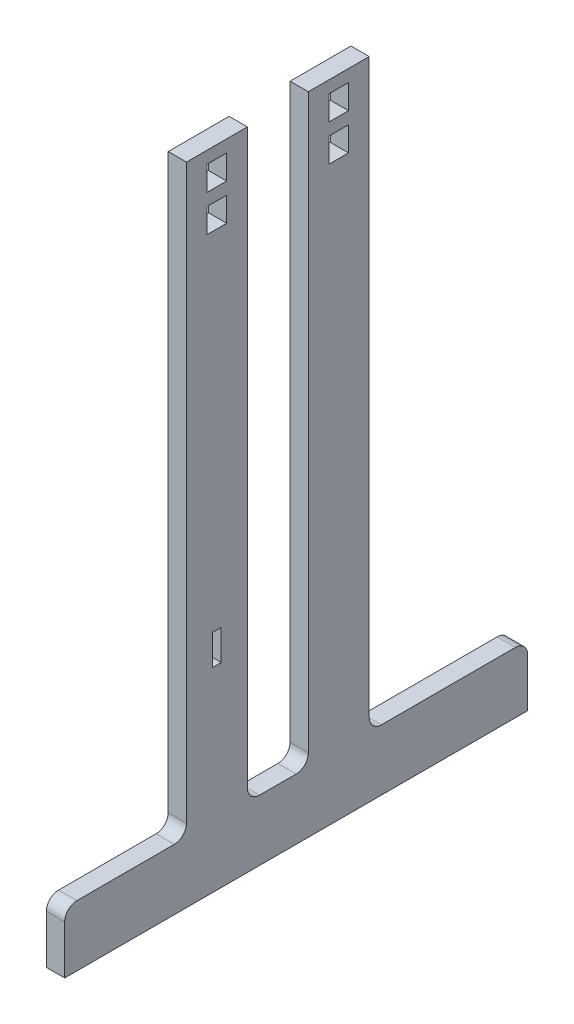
ISO-10303-21;
HEADER;
FILE_DESCRIPTION(('STEP AP214'),'2;1');
FILE_NAME('part.step','',(''),(''),'','','');
FILE_SCHEMA(('AUTOMOTIVE_DESIGN { 1 0 10303 214 1 1 1 1 }'));
ENDSEC;
DATA;
#1=APPLICATION_CONTEXT('core data for automotive mechanical design processes');
#2=APPLICATION_PROTOCOL_DEFINITION('international standard','automotive_design',2000,#1);
#3=PRODUCT_CONTEXT('',#1,'mechanical');
#4=PRODUCT('Part','Part','',(#3));
#5=PRODUCT_RELATED_PRODUCT_CATEGORY('part','',(#4));
#6=PRODUCT_DEFINITION_FORMATION('','',#4);
#7=PRODUCT_DEFINITION_CONTEXT('part definition',#1,'design');
#8=PRODUCT_DEFINITION('design','',#6,#7);
#9=PRODUCT_DEFINITION_SHAPE('','',#8);
#10=(LENGTH_UNIT() NAMED_UNIT(*) SI_UNIT(.MILLI.,.METRE.));
#11=(NAMED_UNIT(*) PLANE_ANGLE_UNIT() SI_UNIT($,.RADIAN.));
#12=(NAMED_UNIT(*) SI_UNIT($,.STERADIAN.) SOLID_ANGLE_UNIT());
#13=UNCERTAINTY_MEASURE_WITH_UNIT(LENGTH_MEASURE(1.E-05),#10,'distance_accuracy_value','');
#14=(GEOMETRIC_REPRESENTATION_CONTEXT(3) GLOBAL_UNCERTAINTY_ASSIGNED_CONTEXT((#13)) GLOBAL_UNIT_ASSIGNED_CONTEXT((#10,
#11,#12)) REPRESENTATION_CONTEXT('',''));
#15=CARTESIAN_POINT('',(0.,0.,0.));
#16=DIRECTION('',(0.,0.,1.));
#17=DIRECTION('',(1.,0.,0.));
#18=AXIS2_PLACEMENT_3D('',#15,#16,#17);
#19=CARTESIAN_POINT('',(15.,0.,0.));
#20=DIRECTION('',(1.,0.,0.));
#21=DIRECTION('',(0.,0.,-1.));
#22=AXIS2_PLACEMENT_3D('',#19,#20,#21);
#23=PLANE('',#22);
#24=DIRECTION('',(0.,1.,0.));
#25=VECTOR('',#24,1.);
#26=CARTESIAN_POINT('',(15.,0.,-380.));
#27=LINE('',#26,#25);
#28=CARTESIAN_POINT('',(15.,0.,-380.));
#29=VERTEX_POINT('',#28);
#30=CARTESIAN_POINT('',(15.,40.,-380.));
#31=VERTEX_POINT('',#30);
#32=EDGE_CURVE('E459',#29,#31,#27,.T.);
#33=ORIENTED_EDGE('',*,*,#32,.T.);
#34=CARTESIAN_POINT('',(15.,40.,-370.));
#35=DIRECTION('',(1.,0.,0.));
#36=DIRECTION('',(0.,0.,-1.));
#37=AXIS2_PLACEMENT_3D('',#34,#35,#36);
#38=CIRCLE('',#37,10.);
#39=CARTESIAN_POINT('',(15.,50.,-370.));
#40=VERTEX_POINT('',#39);
#41=EDGE_CURVE('E11',#31,#40,#38,.T.);
#42=ORIENTED_EDGE('',*,*,#41,.T.);
#43=DIRECTION('',(0.,0.,1.));
#44=VECTOR('',#43,1.);
#45=CARTESIAN_POINT('',(15.,50.,-380.));
#46=LINE('',#45,#44);
#47=CARTESIAN_POINT('',(15.,50.,-260.));
#48=VERTEX_POINT('',#47);
#49=EDGE_CURVE('E462',#40,#48,#46,.T.);
#50=ORIENTED_EDGE('',*,*,#49,.T.);
#51=CARTESIAN_POINT('',(15.,60.,-260.));
#52=DIRECTION('',(1.,0.,0.));
#53=DIRECTION('',(0.,0.,-1.));
#54=AXIS2_PLACEMENT_3D('',#51,#52,#53);
#55=CIRCLE('',#54,10.);
#56=CARTESIAN_POINT('',(15.,60.,-250.));
#57=VERTEX_POINT('',#56);
#58=EDGE_CURVE('E550',#48,#57,#55,.F.);
#59=ORIENTED_EDGE('',*,*,#58,.T.);
#60=DIRECTION('',(0.,1.,0.));
#61=VECTOR('',#60,1.);
#62=CARTESIAN_POINT('',(15.,50.,-250.));
#63=LINE('',#62,#61);
#64=CARTESIAN_POINT('',(15.,530.,-250.));
#65=VERTEX_POINT('',#64);
#66=EDGE_CURVE('E464',#57,#65,#63,.T.);
#67=ORIENTED_EDGE('',*,*,#66,.T.);
#68=DIRECTION('',(0.,0.,1.));
#69=VECTOR('',#68,1.);
#70=CARTESIAN_POINT('',(15.,530.,-250.));
#71=LINE('',#70,#69);
#72=CARTESIAN_POINT('',(15.,530.,-200.));
#73=VERTEX_POINT('',#72);
#74=EDGE_CURVE('E466',#65,#73,#71,.T.);
#75=ORIENTED_EDGE('',*,*,#74,.T.);
#76=DIRECTION('',(0.,-1.,0.));
#77=VECTOR('',#76,1.);
#78=CARTESIAN_POINT('',(15.,530.,-200.));
#79=LINE('',#78,#77);
#80=CARTESIAN_POINT('',(15.,60.0000000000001,-200.));
#81=VERTEX_POINT('',#80);
#82=EDGE_CURVE('E468',#73,#81,#79,.T.);
#83=ORIENTED_EDGE('',*,*,#82,.T.);
#84=CARTESIAN_POINT('',(15.,60.,-190.));
#85=DIRECTION('',(1.,0.,0.));
#86=DIRECTION('',(0.,0.,-1.));
#87=AXIS2_PLACEMENT_3D('',#84,#85,#86);
#88=CIRCLE('',#87,10.);
#89=CARTESIAN_POINT('',(15.,50.,-190.));
#90=VERTEX_POINT('',#89);
#91=EDGE_CURVE('E554',#81,#90,#88,.F.);
#92=ORIENTED_EDGE('',*,*,#91,.T.);
#93=DIRECTION('',(0.,0.,1.));
#94=VECTOR('',#93,1.);
#95=CARTESIAN_POINT('',(15.,50.,-200.));
#96=LINE('',#95,#94);
#97=CARTESIAN_POINT('',(15.,50.,-160.));
#98=VERTEX_POINT('',#97);
#99=EDGE_CURVE('E471',#90,#98,#96,.T.);
#100=ORIENTED_EDGE('',*,*,#99,.T.);
#101=CARTESIAN_POINT('',(15.,60.,-160.));
#102=DIRECTION('',(1.,0.,0.));
#103=DIRECTION('',(0.,0.,-1.));
#104=AXIS2_PLACEMENT_3D('',#101,#102,#103);
#105=CIRCLE('',#104,10.);
#106=CARTESIAN_POINT('',(15.,60.,-150.));
#107=VERTEX_POINT('',#106);
#108=EDGE_CURVE('E558',#98,#107,#105,.F.);
#109=ORIENTED_EDGE('',*,*,#108,.T.);
#110=DIRECTION('',(0.,1.,0.));
#111=VECTOR('',#110,1.);
#112=CARTESIAN_POINT('',(15.,50.,-150.));
#113=LINE('',#112,#111);
#114=CARTESIAN_POINT('',(15.,530.,-150.));
#115=VERTEX_POINT('',#114);
#116=EDGE_CURVE('E474',#107,#115,#113,.T.);
#117=ORIENTED_EDGE('',*,*,#116,.T.);
#118=DIRECTION('',(0.,0.,1.));
#119=VECTOR('',#118,1.);
#120=CARTESIAN_POINT('',(15.,530.,-150.));
#121=LINE('',#120,#119);
#122=CARTESIAN_POINT('',(15.,530.,-99.9999999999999));
#123=VERTEX_POINT('',#122);
#124=EDGE_CURVE('E476',#115,#123,#121,.T.);
#125=ORIENTED_EDGE('',*,*,#124,.T.);
#126=DIRECTION('',(0.,-1.,0.));
#127=VECTOR('',#126,1.);
#128=CARTESIAN_POINT('',(15.,530.,-99.9999999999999));
#129=LINE('',#128,#127);
#130=CARTESIAN_POINT('',(15.,60.,-100.));
#131=VERTEX_POINT('',#130);
#132=EDGE_CURVE('E478',#123,#131,#129,.T.);
#133=ORIENTED_EDGE('',*,*,#132,.T.);
#134=CARTESIAN_POINT('',(15.,60.,-90.));
#135=DIRECTION('',(1.,0.,0.));
#136=DIRECTION('',(0.,0.,-1.));
#137=AXIS2_PLACEMENT_3D('',#134,#135,#136);
#138=CIRCLE('',#137,10.);
#139=CARTESIAN_POINT('',(15.,50.,-90.));
#140=VERTEX_POINT('',#139);
#141=EDGE_CURVE('E562',#131,#140,#138,.F.);
#142=ORIENTED_EDGE('',*,*,#141,.T.);
#143=DIRECTION('',(0.,0.,1.));
#144=VECTOR('',#143,1.);
#145=CARTESIAN_POINT('',(15.,50.,-100.));
#146=LINE('',#145,#144);
#147=CARTESIAN_POINT('',(15.,50.,-9.99999999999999));
#148=VERTEX_POINT('',#147);
#149=EDGE_CURVE('E451',#140,#148,#146,.T.);
#150=ORIENTED_EDGE('',*,*,#149,.T.);
#151=CARTESIAN_POINT('',(15.,40.,-9.99999999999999));
#152=DIRECTION('',(1.,0.,0.));
#153=DIRECTION('',(0.,0.,-1.));
#154=AXIS2_PLACEMENT_3D('',#151,#152,#153);
#155=CIRCLE('',#154,10.);
#156=CARTESIAN_POINT('',(15.,40.,0.));
#157=VERTEX_POINT('',#156);
#158=EDGE_CURVE('E572',#148,#157,#155,.T.);
#159=ORIENTED_EDGE('',*,*,#158,.T.);
#160=DIRECTION('',(0.,-1.,0.));
#161=VECTOR('',#160,1.);
#162=CARTESIAN_POINT('',(15.,50.,0.));
#163=LINE('',#162,#161);
#164=CARTESIAN_POINT('',(15.,0.,0.));
#165=VERTEX_POINT('',#164);
#166=EDGE_CURVE('E454',#157,#165,#163,.T.);
#167=ORIENTED_EDGE('',*,*,#166,.T.);
#168=DIRECTION('',(0.,0.,-1.));
#169=VECTOR('',#168,1.);
#170=CARTESIAN_POINT('',(15.,0.,0.));
#171=LINE('',#170,#169);
#172=EDGE_CURVE('E457',#165,#29,#171,.T.);
#173=ORIENTED_EDGE('',*,*,#172,.T.);
#174=EDGE_LOOP('',(#33,#42,#50,#59,#67,#75,#83,#92,#100,#109,#117,#125,#133,#142,#150,#159,#167,#173));
#175=FACE_BOUND('',#174,.T.);
#176=DIRECTION('',(0.,0.,1.));
#177=VECTOR('',#176,1.);
#178=CARTESIAN_POINT('',(15.,520.,-117.));
#179=LINE('',#178,#177);
#180=CARTESIAN_POINT('',(15.,520.,-133.));
#181=VERTEX_POINT('',#180);
#182=CARTESIAN_POINT('',(15.,520.,-117.));
#183=VERTEX_POINT('',#182);
#184=EDGE_CURVE('E422',#181,#183,#179,.T.);
#185=ORIENTED_EDGE('',*,*,#184,.F.);
#186=DIRECTION('',(0.,1.,0.));
#187=VECTOR('',#186,1.);
#188=CARTESIAN_POINT('',(15.,520.,-133.));
#189=LINE('',#188,#187);
#190=CARTESIAN_POINT('',(15.,500.,-133.));
#191=VERTEX_POINT('',#190);
#192=EDGE_CURVE('E420',#191,#181,#189,.T.);
#193=ORIENTED_EDGE('',*,*,#192,.F.);
#194=DIRECTION('',(0.,0.,-1.));
#195=VECTOR('',#194,1.);
#196=CARTESIAN_POINT('',(15.,500.,-117.));
#197=LINE('',#196,#195);
#198=CARTESIAN_POINT('',(15.,500.,-117.));
#199=VERTEX_POINT('',#198);
#200=EDGE_CURVE('E428',#199,#191,#197,.T.);
#201=ORIENTED_EDGE('',*,*,#200,.F.);
#202=DIRECTION('',(0.,-1.,0.));
#203=VECTOR('',#202,1.);
#204=CARTESIAN_POINT('',(15.,520.,-117.));
#205=LINE('',#204,#203);
#206=EDGE_CURVE('E425',#183,#199,#205,.T.);
#207=ORIENTED_EDGE('',*,*,#206,.F.);
#208=EDGE_LOOP('',(#185,#193,#201,#207));
#209=FACE_BOUND('',#208,.T.);
#210=DIRECTION('',(0.,0.,1.));
#211=VECTOR('',#210,1.);
#212=CARTESIAN_POINT('',(15.,490.,-217.));
#213=LINE('',#212,#211);
#214=CARTESIAN_POINT('',(15.,490.,-233.));
#215=VERTEX_POINT('',#214);
#216=CARTESIAN_POINT('',(15.,490.,-217.));
#217=VERTEX_POINT('',#216);
#218=EDGE_CURVE('E355',#215,#217,#213,.T.);
#219=ORIENTED_EDGE('',*,*,#218,.F.);
#220=DIRECTION('',(0.,1.,0.));
#221=VECTOR('',#220,1.);
#222=CARTESIAN_POINT('',(15.,490.,-233.));
#223=LINE('',#222,#221);
#224=CARTESIAN_POINT('',(15.,470.,-233.));
#225=VERTEX_POINT('',#224);
#226=EDGE_CURVE('E341',#225,#215,#223,.T.);
#227=ORIENTED_EDGE('',*,*,#226,.F.);
#228=DIRECTION('',(0.,0.,-1.));
#229=VECTOR('',#228,1.);
#230=CARTESIAN_POINT('',(15.,470.,-217.));
#231=LINE('',#230,#229);
#232=CARTESIAN_POINT('',(15.,470.,-217.));
#233=VERTEX_POINT('',#232);
#234=EDGE_CURVE('E336',#233,#225,#231,.T.);
#235=ORIENTED_EDGE('',*,*,#234,.F.);
#236=DIRECTION('',(0.,-1.,0.));
#237=VECTOR('',#236,1.);
#238=CARTESIAN_POINT('',(15.,490.,-217.));
#239=LINE('',#238,#237);
#240=EDGE_CURVE('E352',#217,#233,#239,.T.);
#241=ORIENTED_EDGE('',*,*,#240,.F.);
#242=EDGE_LOOP('',(#219,#227,#235,#241));
#243=FACE_BOUND('',#242,.T.);
#244=DIRECTION('',(0.,0.,1.));
#245=VECTOR('',#244,1.);
#246=CARTESIAN_POINT('',(15.,490.,-117.));
#247=LINE('',#246,#245);
#248=CARTESIAN_POINT('',(15.,490.,-133.));
#249=VERTEX_POINT('',#248);
#250=CARTESIAN_POINT('',(15.,490.,-117.));
#251=VERTEX_POINT('',#250);
#252=EDGE_CURVE('E417',#249,#251,#247,.T.);
#253=ORIENTED_EDGE('',*,*,#252,.F.);
#254=DIRECTION('',(0.,1.,0.));
#255=VECTOR('',#254,1.);
#256=CARTESIAN_POINT('',(15.,490.,-133.));
#257=LINE('',#256,#255);
#258=CARTESIAN_POINT('',(15.,470.,-133.));
#259=VERTEX_POINT('',#258);
#260=EDGE_CURVE('E405',#259,#249,#257,.T.);
#261=ORIENTED_EDGE('',*,*,#260,.F.);
#262=DIRECTION('',(0.,0.,-1.));
#263=VECTOR('',#262,1.);
#264=CARTESIAN_POINT('',(15.,470.,-117.));
#265=LINE('',#264,#263);
#266=CARTESIAN_POINT('',(15.,470.,-117.));
#267=VERTEX_POINT('',#266);
#268=EDGE_CURVE('E400',#267,#259,#265,.T.);
#269=ORIENTED_EDGE('',*,*,#268,.F.);
#270=DIRECTION('',(0.,-1.,0.));
#271=VECTOR('',#270,1.);
#272=CARTESIAN_POINT('',(15.,490.,-117.));
#273=LINE('',#272,#271);
#274=EDGE_CURVE('E414',#251,#267,#273,.T.);
#275=ORIENTED_EDGE('',*,*,#274,.F.);
#276=EDGE_LOOP('',(#253,#261,#269,#275));
#277=FACE_BOUND('',#276,.T.);
#278=DIRECTION('',(0.,0.,1.));
#279=VECTOR('',#278,1.);
#280=CARTESIAN_POINT('',(15.,520.,-217.));
#281=LINE('',#280,#279);
#282=CARTESIAN_POINT('',(15.,520.,-233.));
#283=VERTEX_POINT('',#282);
#284=CARTESIAN_POINT('',(15.,520.,-217.));
#285=VERTEX_POINT('',#284);
#286=EDGE_CURVE('E388',#283,#285,#281,.T.);
#287=ORIENTED_EDGE('',*,*,#286,.F.);
#288=DIRECTION('',(0.,1.,0.));
#289=VECTOR('',#288,1.);
#290=CARTESIAN_POINT('',(15.,520.,-233.));
#291=LINE('',#290,#289);
#292=CARTESIAN_POINT('',(15.,500.,-233.));
#293=VERTEX_POINT('',#292);
#294=EDGE_CURVE('E374',#293,#283,#291,.T.);
#295=ORIENTED_EDGE('',*,*,#294,.F.);
#296=DIRECTION('',(0.,0.,-1.));
#297=VECTOR('',#296,1.);
#298=CARTESIAN_POINT('',(15.,500.,-217.));
#299=LINE('',#298,#297);
#300=CARTESIAN_POINT('',(15.,500.,-217.));
#301=VERTEX_POINT('',#300);
#302=EDGE_CURVE('E369',#301,#293,#299,.T.);
#303=ORIENTED_EDGE('',*,*,#302,.F.);
#304=DIRECTION('',(0.,-1.,0.));
#305=VECTOR('',#304,1.);
#306=CARTESIAN_POINT('',(15.,520.,-217.));
#307=LINE('',#306,#305);
#308=EDGE_CURVE('E385',#285,#301,#307,.T.);
#309=ORIENTED_EDGE('',*,*,#308,.F.);
#310=EDGE_LOOP('',(#287,#295,#303,#309));
#311=FACE_BOUND('',#310,.T.);
#312=DIRECTION('',(0.,0.,1.));
#313=VECTOR('',#312,1.);
#314=CARTESIAN_POINT('',(15.,185.,-121.5));
#315=LINE('',#314,#313);
#316=CARTESIAN_POINT('',(15.,185.,-128.5));
#317=VERTEX_POINT('',#316);
#318=CARTESIAN_POINT('',(15.,185.,-121.5));
#319=VERTEX_POINT('',#318);
#320=EDGE_CURVE('E299',#317,#319,#315,.T.);
#321=ORIENTED_EDGE('',*,*,#320,.F.);
#322=DIRECTION('',(0.,1.,0.));
#323=VECTOR('',#322,1.);
#324=CARTESIAN_POINT('',(15.,185.,-128.5));
#325=LINE('',#324,#323);
#326=CARTESIAN_POINT('',(15.,160.,-128.5));
#327=VERTEX_POINT('',#326);
#328=EDGE_CURVE('E291',#327,#317,#325,.T.);
#329=ORIENTED_EDGE('',*,*,#328,.F.);
#330=DIRECTION('',(0.,0.,-1.));
#331=VECTOR('',#330,1.);
#332=CARTESIAN_POINT('',(15.,160.,-121.5));
#333=LINE('',#332,#331);
#334=CARTESIAN_POINT('',(15.,160.,-121.5));
#335=VERTEX_POINT('',#334);
#336=EDGE_CURVE('E313',#335,#327,#333,.T.);
#337=ORIENTED_EDGE('',*,*,#336,.F.);
#338=DIRECTION('',(0.,-1.,0.));
#339=VECTOR('',#338,1.);
#340=CARTESIAN_POINT('',(15.,185.,-121.5));
#341=LINE('',#340,#339);
#342=EDGE_CURVE('E311',#319,#335,#341,.T.);
#343=ORIENTED_EDGE('',*,*,#342,.F.);
#344=EDGE_LOOP('',(#321,#329,#337,#343));
#345=FACE_BOUND('',#344,.T.);
#346=ADVANCED_FACE('F47',(#175,#209,#243,#277,#311,#345),#23,.T.);
#347=CARTESIAN_POINT('',(0.,0.,0.));
#348=DIRECTION('',(1.,0.,0.));
#349=DIRECTION('',(0.,0.,-1.));
#350=AXIS2_PLACEMENT_3D('',#347,#348,#349);
#351=PLANE('',#350);
#352=DIRECTION('',(0.,1.,0.));
#353=VECTOR('',#352,1.);
#354=CARTESIAN_POINT('',(0.,520.,-233.));
#355=LINE('',#354,#353);
#356=CARTESIAN_POINT('',(0.,500.,-233.));
#357=VERTEX_POINT('',#356);
#358=CARTESIAN_POINT('',(0.,520.,-233.));
#359=VERTEX_POINT('',#358);
#360=EDGE_CURVE('E380',#357,#359,#355,.T.);
#361=ORIENTED_EDGE('',*,*,#360,.T.);
#362=DIRECTION('',(0.,0.,1.));
#363=VECTOR('',#362,1.);
#364=CARTESIAN_POINT('',(0.,520.,-217.));
#365=LINE('',#364,#363);
#366=CARTESIAN_POINT('',(0.,520.,-217.));
#367=VERTEX_POINT('',#366);
#368=EDGE_CURVE('E377',#359,#367,#365,.T.);
#369=ORIENTED_EDGE('',*,*,#368,.T.);
#370=DIRECTION('',(0.,-1.,0.));
#371=VECTOR('',#370,1.);
#372=CARTESIAN_POINT('',(0.,520.,-217.));
#373=LINE('',#372,#371);
#374=CARTESIAN_POINT('',(0.,500.,-217.));
#375=VERTEX_POINT('',#374);
#376=EDGE_CURVE('E373',#367,#375,#373,.T.);
#377=ORIENTED_EDGE('',*,*,#376,.T.);
#378=DIRECTION('',(0.,0.,-1.));
#379=VECTOR('',#378,1.);
#380=CARTESIAN_POINT('',(0.,500.,-217.));
#381=LINE('',#380,#379);
#382=EDGE_CURVE('E370',#375,#357,#381,.T.);
#383=ORIENTED_EDGE('',*,*,#382,.T.);
#384=EDGE_LOOP('',(#361,#369,#377,#383));
#385=FACE_BOUND('',#384,.T.);
#386=DIRECTION('',(0.,1.,0.));
#387=VECTOR('',#386,1.);
#388=CARTESIAN_POINT('',(0.,490.,-233.));
#389=LINE('',#388,#387);
#390=CARTESIAN_POINT('',(0.,470.,-233.));
#391=VERTEX_POINT('',#390);
#392=CARTESIAN_POINT('',(0.,490.,-233.));
#393=VERTEX_POINT('',#392);
#394=EDGE_CURVE('E347',#391,#393,#389,.T.);
#395=ORIENTED_EDGE('',*,*,#394,.T.);
#396=DIRECTION('',(0.,0.,1.));
#397=VECTOR('',#396,1.);
#398=CARTESIAN_POINT('',(0.,490.,-217.));
#399=LINE('',#398,#397);
#400=CARTESIAN_POINT('',(0.,490.,-217.));
#401=VERTEX_POINT('',#400);
#402=EDGE_CURVE('E344',#393,#401,#399,.T.);
#403=ORIENTED_EDGE('',*,*,#402,.T.);
#404=DIRECTION('',(0.,-1.,0.));
#405=VECTOR('',#404,1.);
#406=CARTESIAN_POINT('',(0.,490.,-217.));
#407=LINE('',#406,#405);
#408=CARTESIAN_POINT('',(0.,470.,-217.));
#409=VERTEX_POINT('',#408);
#410=EDGE_CURVE('E340',#401,#409,#407,.T.);
#411=ORIENTED_EDGE('',*,*,#410,.T.);
#412=DIRECTION('',(0.,0.,-1.));
#413=VECTOR('',#412,1.);
#414=CARTESIAN_POINT('',(0.,470.,-217.));
#415=LINE('',#414,#413);
#416=EDGE_CURVE('E337',#409,#391,#415,.T.);
#417=ORIENTED_EDGE('',*,*,#416,.T.);
#418=EDGE_LOOP('',(#395,#403,#411,#417));
#419=FACE_BOUND('',#418,.T.);
#420=DIRECTION('',(0.,0.,1.));
#421=VECTOR('',#420,1.);
#422=CARTESIAN_POINT('',(0.,50.,-380.));
#423=LINE('',#422,#421);
#424=CARTESIAN_POINT('',(0.,50.,-370.));
#425=VERTEX_POINT('',#424);
#426=CARTESIAN_POINT('',(0.,50.,-260.));
#427=VERTEX_POINT('',#426);
#428=EDGE_CURVE('E491',#425,#427,#423,.T.);
#429=ORIENTED_EDGE('',*,*,#428,.F.);
#430=CARTESIAN_POINT('',(0.,40.,-370.));
#431=DIRECTION('',(1.,0.,0.));
#432=DIRECTION('',(0.,0.,-1.));
#433=AXIS2_PLACEMENT_3D('',#430,#431,#432);
#434=CIRCLE('',#433,10.);
#435=CARTESIAN_POINT('',(0.,40.,-380.));
#436=VERTEX_POINT('',#435);
#437=EDGE_CURVE('E55',#425,#436,#434,.F.);
#438=ORIENTED_EDGE('',*,*,#437,.T.);
#439=DIRECTION('',(0.,1.,0.));
#440=VECTOR('',#439,1.);
#441=CARTESIAN_POINT('',(0.,0.,-380.));
#442=LINE('',#441,#440);
#443=CARTESIAN_POINT('',(0.,0.,-380.));
#444=VERTEX_POINT('',#443);
#445=EDGE_CURVE('E488',#444,#436,#442,.T.);
#446=ORIENTED_EDGE('',*,*,#445,.F.);
#447=DIRECTION('',(0.,0.,-1.));
#448=VECTOR('',#447,1.);
#449=CARTESIAN_POINT('',(0.,0.,0.));
#450=LINE('',#449,#448);
#451=CARTESIAN_POINT('',(0.,0.,0.));
#452=VERTEX_POINT('',#451);
#453=EDGE_CURVE('E486',#452,#444,#450,.T.);
#454=ORIENTED_EDGE('',*,*,#453,.F.);
#455=DIRECTION('',(0.,-1.,0.));
#456=VECTOR('',#455,1.);
#457=CARTESIAN_POINT('',(0.,50.,0.));
#458=LINE('',#457,#456);
#459=CARTESIAN_POINT('',(0.,40.,0.));
#460=VERTEX_POINT('',#459);
#461=EDGE_CURVE('E484',#460,#452,#458,.T.);
#462=ORIENTED_EDGE('',*,*,#461,.F.);
#463=CARTESIAN_POINT('',(0.,40.,-9.99999999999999));
#464=DIRECTION('',(1.,0.,0.));
#465=DIRECTION('',(0.,0.,-1.));
#466=AXIS2_PLACEMENT_3D('',#463,#464,#465);
#467=CIRCLE('',#466,10.);
#468=CARTESIAN_POINT('',(0.,50.,-9.99999999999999));
#469=VERTEX_POINT('',#468);
#470=EDGE_CURVE('E570',#460,#469,#467,.F.);
#471=ORIENTED_EDGE('',*,*,#470,.T.);
#472=DIRECTION('',(0.,0.,1.));
#473=VECTOR('',#472,1.);
#474=CARTESIAN_POINT('',(0.,50.,-100.));
#475=LINE('',#474,#473);
#476=CARTESIAN_POINT('',(0.,50.,-90.));
#477=VERTEX_POINT('',#476);
#478=EDGE_CURVE('E450',#477,#469,#475,.T.);
#479=ORIENTED_EDGE('',*,*,#478,.F.);
#480=CARTESIAN_POINT('',(0.,60.,-90.));
#481=DIRECTION('',(1.,0.,0.));
#482=DIRECTION('',(0.,0.,-1.));
#483=AXIS2_PLACEMENT_3D('',#480,#481,#482);
#484=CIRCLE('',#483,10.);
#485=CARTESIAN_POINT('',(0.,60.,-100.));
#486=VERTEX_POINT('',#485);
#487=EDGE_CURVE('E560',#477,#486,#484,.T.);
#488=ORIENTED_EDGE('',*,*,#487,.T.);
#489=DIRECTION('',(0.,-1.,0.));
#490=VECTOR('',#489,1.);
#491=CARTESIAN_POINT('',(0.,530.,-99.9999999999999));
#492=LINE('',#491,#490);
#493=CARTESIAN_POINT('',(0.,530.,-99.9999999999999));
#494=VERTEX_POINT('',#493);
#495=EDGE_CURVE('E455',#494,#486,#492,.T.);
#496=ORIENTED_EDGE('',*,*,#495,.F.);
#497=DIRECTION('',(0.,0.,1.));
#498=VECTOR('',#497,1.);
#499=CARTESIAN_POINT('',(0.,530.,-150.));
#500=LINE('',#499,#498);
#501=CARTESIAN_POINT('',(0.,530.,-150.));
#502=VERTEX_POINT('',#501);
#503=EDGE_CURVE('E505',#502,#494,#500,.T.);
#504=ORIENTED_EDGE('',*,*,#503,.F.);
#505=DIRECTION('',(0.,1.,0.));
#506=VECTOR('',#505,1.);
#507=CARTESIAN_POINT('',(0.,50.,-150.));
#508=LINE('',#507,#506);
#509=CARTESIAN_POINT('',(0.,60.,-150.));
#510=VERTEX_POINT('',#509);
#511=EDGE_CURVE('E503',#510,#502,#508,.T.);
#512=ORIENTED_EDGE('',*,*,#511,.F.);
#513=CARTESIAN_POINT('',(0.,60.,-160.));
#514=DIRECTION('',(1.,0.,0.));
#515=DIRECTION('',(0.,0.,-1.));
#516=AXIS2_PLACEMENT_3D('',#513,#514,#515);
#517=CIRCLE('',#516,10.);
#518=CARTESIAN_POINT('',(0.,50.,-160.));
#519=VERTEX_POINT('',#518);
#520=EDGE_CURVE('E556',#510,#519,#517,.T.);
#521=ORIENTED_EDGE('',*,*,#520,.T.);
#522=DIRECTION('',(0.,0.,1.));
#523=VECTOR('',#522,1.);
#524=CARTESIAN_POINT('',(0.,50.,-200.));
#525=LINE('',#524,#523);
#526=CARTESIAN_POINT('',(0.,50.,-190.));
#527=VERTEX_POINT('',#526);
#528=EDGE_CURVE('E500',#527,#519,#525,.T.);
#529=ORIENTED_EDGE('',*,*,#528,.F.);
#530=CARTESIAN_POINT('',(0.,60.,-190.));
#531=DIRECTION('',(1.,0.,0.));
#532=DIRECTION('',(0.,0.,-1.));
#533=AXIS2_PLACEMENT_3D('',#530,#531,#532);
#534=CIRCLE('',#533,10.);
#535=CARTESIAN_POINT('',(0.,60.0000000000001,-200.));
#536=VERTEX_POINT('',#535);
#537=EDGE_CURVE('E552',#527,#536,#534,.T.);
#538=ORIENTED_EDGE('',*,*,#537,.T.);
#539=DIRECTION('',(0.,-1.,0.));
#540=VECTOR('',#539,1.);
#541=CARTESIAN_POINT('',(0.,530.,-200.));
#542=LINE('',#541,#540);
#543=CARTESIAN_POINT('',(0.,530.,-200.));
#544=VERTEX_POINT('',#543);
#545=EDGE_CURVE('E497',#544,#536,#542,.T.);
#546=ORIENTED_EDGE('',*,*,#545,.F.);
#547=DIRECTION('',(0.,0.,1.));
#548=VECTOR('',#547,1.);
#549=CARTESIAN_POINT('',(0.,530.,-250.));
#550=LINE('',#549,#548);
#551=CARTESIAN_POINT('',(0.,530.,-250.));
#552=VERTEX_POINT('',#551);
#553=EDGE_CURVE('E495',#552,#544,#550,.T.);
#554=ORIENTED_EDGE('',*,*,#553,.F.);
#555=DIRECTION('',(0.,1.,0.));
#556=VECTOR('',#555,1.);
#557=CARTESIAN_POINT('',(0.,50.,-250.));
#558=LINE('',#557,#556);
#559=CARTESIAN_POINT('',(0.,60.,-250.));
#560=VERTEX_POINT('',#559);
#561=EDGE_CURVE('E493',#560,#552,#558,.T.);
#562=ORIENTED_EDGE('',*,*,#561,.F.);
#563=CARTESIAN_POINT('',(0.,60.,-260.));
#564=DIRECTION('',(1.,0.,0.));
#565=DIRECTION('',(0.,0.,-1.));
#566=AXIS2_PLACEMENT_3D('',#563,#564,#565);
#567=CIRCLE('',#566,10.);
#568=EDGE_CURVE('E547',#560,#427,#567,.T.);
#569=ORIENTED_EDGE('',*,*,#568,.T.);
#570=EDGE_LOOP('',(#429,#438,#446,#454,#462,#471,#479,#488,#496,#504,#512,#521,#529,#538,#546,
#554,#562,#569));
#571=FACE_BOUND('',#570,.T.);
#572=DIRECTION('',(0.,1.,0.));
#573=VECTOR('',#572,1.);
#574=CARTESIAN_POINT('',(0.,520.,-133.));
#575=LINE('',#574,#573);
#576=CARTESIAN_POINT('',(0.,500.,-133.));
#577=VERTEX_POINT('',#576);
#578=CARTESIAN_POINT('',(0.,520.,-133.));
#579=VERTEX_POINT('',#578);
#580=EDGE_CURVE('E383',#577,#579,#575,.T.);
#581=ORIENTED_EDGE('',*,*,#580,.T.);
#582=DIRECTION('',(0.,0.,1.));
#583=VECTOR('',#582,1.);
#584=CARTESIAN_POINT('',(0.,520.,-117.));
#585=LINE('',#584,#583);
#586=CARTESIAN_POINT('',(0.,520.,-117.));
#587=VERTEX_POINT('',#586);
#588=EDGE_CURVE('E433',#579,#587,#585,.T.);
#589=ORIENTED_EDGE('',*,*,#588,.T.);
#590=DIRECTION('',(0.,-1.,0.));
#591=VECTOR('',#590,1.);
#592=CARTESIAN_POINT('',(0.,520.,-117.));
#593=LINE('',#592,#591);
#594=CARTESIAN_POINT('',(0.,500.,-117.));
#595=VERTEX_POINT('',#594);
#596=EDGE_CURVE('E436',#587,#595,#593,.T.);
#597=ORIENTED_EDGE('',*,*,#596,.T.);
#598=DIRECTION('',(0.,0.,-1.));
#599=VECTOR('',#598,1.);
#600=CARTESIAN_POINT('',(0.,500.,-117.));
#601=LINE('',#600,#599);
#602=EDGE_CURVE('E423',#595,#577,#601,.T.);
#603=ORIENTED_EDGE('',*,*,#602,.T.);
#604=EDGE_LOOP('',(#581,#589,#597,#603));
#605=FACE_BOUND('',#604,.T.);
#606=DIRECTION('',(0.,1.,0.));
#607=VECTOR('',#606,1.);
#608=CARTESIAN_POINT('',(0.,490.,-133.));
#609=LINE('',#608,#607);
#610=CARTESIAN_POINT('',(0.,470.,-133.));
#611=VERTEX_POINT('',#610);
#612=CARTESIAN_POINT('',(0.,490.,-133.));
#613=VERTEX_POINT('',#612);
#614=EDGE_CURVE('E362',#611,#613,#609,.T.);
#615=ORIENTED_EDGE('',*,*,#614,.T.);
#616=DIRECTION('',(0.,0.,1.));
#617=VECTOR('',#616,1.);
#618=CARTESIAN_POINT('',(0.,490.,-117.));
#619=LINE('',#618,#617);
#620=CARTESIAN_POINT('',(0.,490.,-117.));
#621=VERTEX_POINT('',#620);
#622=EDGE_CURVE('E408',#613,#621,#619,.T.);
#623=ORIENTED_EDGE('',*,*,#622,.T.);
#624=DIRECTION('',(0.,-1.,0.));
#625=VECTOR('',#624,1.);
#626=CARTESIAN_POINT('',(0.,490.,-117.));
#627=LINE('',#626,#625);
#628=CARTESIAN_POINT('',(0.,470.,-117.));
#629=VERTEX_POINT('',#628);
#630=EDGE_CURVE('E404',#621,#629,#627,.T.);
#631=ORIENTED_EDGE('',*,*,#630,.T.);
#632=DIRECTION('',(0.,0.,-1.));
#633=VECTOR('',#632,1.);
#634=CARTESIAN_POINT('',(0.,470.,-117.));
#635=LINE('',#634,#633);
#636=EDGE_CURVE('E401',#629,#611,#635,.T.);
#637=ORIENTED_EDGE('',*,*,#636,.T.);
#638=EDGE_LOOP('',(#615,#623,#631,#637));
#639=FACE_BOUND('',#638,.T.);
#640=DIRECTION('',(0.,1.,0.));
#641=VECTOR('',#640,1.);
#642=CARTESIAN_POINT('',(0.,185.,-128.5));
#643=LINE('',#642,#641);
#644=CARTESIAN_POINT('',(0.,160.,-128.5));
#645=VERTEX_POINT('',#644);
#646=CARTESIAN_POINT('',(0.,185.,-128.5));
#647=VERTEX_POINT('',#646);
#648=EDGE_CURVE('E70',#645,#647,#643,.T.);
#649=ORIENTED_EDGE('',*,*,#648,.T.);
#650=DIRECTION('',(0.,0.,1.));
#651=VECTOR('',#650,1.);
#652=CARTESIAN_POINT('',(0.,185.,-121.5));
#653=LINE('',#652,#651);
#654=CARTESIAN_POINT('',(0.,185.,-121.5));
#655=VERTEX_POINT('',#654);
#656=EDGE_CURVE('E306',#647,#655,#653,.T.);
#657=ORIENTED_EDGE('',*,*,#656,.T.);
#658=DIRECTION('',(0.,-1.,0.));
#659=VECTOR('',#658,1.);
#660=CARTESIAN_POINT('',(0.,185.,-121.5));
#661=LINE('',#660,#659);
#662=CARTESIAN_POINT('',(0.,160.,-121.5));
#663=VERTEX_POINT('',#662);
#664=EDGE_CURVE('E319',#655,#663,#661,.T.);
#665=ORIENTED_EDGE('',*,*,#664,.T.);
#666=DIRECTION('',(0.,0.,-1.));
#667=VECTOR('',#666,1.);
#668=CARTESIAN_POINT('',(0.,160.,-121.5));
#669=LINE('',#668,#667);
#670=EDGE_CURVE('E300',#663,#645,#669,.T.);
#671=ORIENTED_EDGE('',*,*,#670,.T.);
#672=EDGE_LOOP('',(#649,#657,#665,#671));
#673=FACE_BOUND('',#672,.T.);
#674=ADVANCED_FACE('F583',(#385,#419,#571,#605,#639,#673),#351,.F.);
#675=CARTESIAN_POINT('',(15.,40.,-370.));
#676=DIRECTION('',(1.,0.,0.));
#677=DIRECTION('',(0.,0.,-1.));
#678=AXIS2_PLACEMENT_3D('',#675,#676,#677);
#679=CYLINDRICAL_SURFACE('',#678,10.);
#680=DIRECTION('',(1.,0.,0.));
#681=VECTOR('',#680,1.);
#682=CARTESIAN_POINT('',(15.,40.,-380.));
#683=LINE('',#682,#681);
#684=EDGE_CURVE('E574',#436,#31,#683,.T.);
#685=ORIENTED_EDGE('',*,*,#684,.F.);
#686=ORIENTED_EDGE('',*,*,#437,.F.);
#687=DIRECTION('',(1.,0.,0.));
#688=VECTOR('',#687,1.);
#689=CARTESIAN_POINT('',(15.,50.,-370.));
#690=LINE('',#689,#688);
#691=EDGE_CURVE('E577',#40,#425,#690,.F.);
#692=ORIENTED_EDGE('',*,*,#691,.F.);
#693=ORIENTED_EDGE('',*,*,#41,.F.);
#694=EDGE_LOOP('',(#685,#686,#692,#693));
#695=FACE_BOUND('',#694,.T.);
#696=ADVANCED_FACE('F49',(#695),#679,.T.);
#697=CARTESIAN_POINT('',(15.,40.,-9.99999999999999));
#698=DIRECTION('',(1.,0.,0.));
#699=DIRECTION('',(0.,0.,-1.));
#700=AXIS2_PLACEMENT_3D('',#697,#698,#699);
#701=CYLINDRICAL_SURFACE('',#700,10.);
#702=DIRECTION('',(1.,0.,0.));
#703=VECTOR('',#702,1.);
#704=CARTESIAN_POINT('',(15.,50.,-9.99999999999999));
#705=LINE('',#704,#703);
#706=EDGE_CURVE('E564',#469,#148,#705,.T.);
#707=ORIENTED_EDGE('',*,*,#706,.F.);
#708=ORIENTED_EDGE('',*,*,#470,.F.);
#709=DIRECTION('',(1.,0.,0.));
#710=VECTOR('',#709,1.);
#711=CARTESIAN_POINT('',(15.,40.,0.));
#712=LINE('',#711,#710);
#713=EDGE_CURVE('E567',#157,#460,#712,.F.);
#714=ORIENTED_EDGE('',*,*,#713,.F.);
#715=ORIENTED_EDGE('',*,*,#158,.F.);
#716=EDGE_LOOP('',(#707,#708,#714,#715));
#717=FACE_BOUND('',#716,.T.);
#718=ADVANCED_FACE('F604',(#717),#701,.T.);
#719=CARTESIAN_POINT('',(15.,50.,-100.));
#720=DIRECTION('',(0.,-1.,0.));
#721=DIRECTION('',(0.,0.,-1.));
#722=AXIS2_PLACEMENT_3D('',#719,#720,#721);
#723=PLANE('',#722);
#724=ORIENTED_EDGE('',*,*,#478,.T.);
#725=ORIENTED_EDGE('',*,*,#706,.T.);
#726=ORIENTED_EDGE('',*,*,#149,.F.);
#727=DIRECTION('',(-1.,0.,0.));
#728=VECTOR('',#727,1.);
#729=CARTESIAN_POINT('',(0.,50.,-90.));
#730=LINE('',#729,#728);
#731=EDGE_CURVE('E542',#140,#477,#730,.T.);
#732=ORIENTED_EDGE('',*,*,#731,.T.);
#733=EDGE_LOOP('',(#724,#725,#726,#732));
#734=FACE_BOUND('',#733,.T.);
#735=ADVANCED_FACE('F607',(#734),#723,.F.);
#736=CARTESIAN_POINT('',(15.,50.,0.));
#737=DIRECTION('',(0.,0.,-1.));
#738=DIRECTION('',(0.,1.,0.));
#739=AXIS2_PLACEMENT_3D('',#736,#737,#738);
#740=PLANE('',#739);
#741=ORIENTED_EDGE('',*,*,#166,.F.);
#742=ORIENTED_EDGE('',*,*,#713,.T.);
#743=ORIENTED_EDGE('',*,*,#461,.T.);
#744=DIRECTION('',(-1.,0.,0.));
#745=VECTOR('',#744,1.);
#746=CARTESIAN_POINT('',(15.,0.,0.));
#747=LINE('',#746,#745);
#748=EDGE_CURVE('E523',#165,#452,#747,.T.);
#749=ORIENTED_EDGE('',*,*,#748,.F.);
#750=EDGE_LOOP('',(#741,#742,#743,#749));
#751=FACE_BOUND('',#750,.T.);
#752=ADVANCED_FACE('F601',(#751),#740,.F.);
#753=CARTESIAN_POINT('',(15.,0.,0.));
#754=DIRECTION('',(0.,1.,0.));
#755=DIRECTION('',(0.,0.,1.));
#756=AXIS2_PLACEMENT_3D('',#753,#754,#755);
#757=PLANE('',#756);
#758=ORIENTED_EDGE('',*,*,#453,.T.);
#759=DIRECTION('',(-1.,0.,0.));
#760=VECTOR('',#759,1.);
#761=CARTESIAN_POINT('',(15.,0.,-380.));
#762=LINE('',#761,#760);
#763=EDGE_CURVE('E520',#29,#444,#762,.T.);
#764=ORIENTED_EDGE('',*,*,#763,.F.);
#765=ORIENTED_EDGE('',*,*,#172,.F.);
#766=ORIENTED_EDGE('',*,*,#748,.T.);
#767=EDGE_LOOP('',(#758,#764,#765,#766));
#768=FACE_BOUND('',#767,.T.);
#769=ADVANCED_FACE('F594',(#768),#757,.F.);
#770=CARTESIAN_POINT('',(15.,0.,-380.));
#771=DIRECTION('',(0.,0.,1.));
#772=DIRECTION('',(1.,0.,0.));
#773=AXIS2_PLACEMENT_3D('',#770,#771,#772);
#774=PLANE('',#773);
#775=ORIENTED_EDGE('',*,*,#445,.T.);
#776=ORIENTED_EDGE('',*,*,#684,.T.);
#777=ORIENTED_EDGE('',*,*,#32,.F.);
#778=ORIENTED_EDGE('',*,*,#763,.T.);
#779=EDGE_LOOP('',(#775,#776,#777,#778));
#780=FACE_BOUND('',#779,.T.);
#781=ADVANCED_FACE('F590',(#780),#774,.F.);
#782=CARTESIAN_POINT('',(15.,50.,-380.));
#783=DIRECTION('',(0.,-1.,0.));
#784=DIRECTION('',(0.,0.,-1.));
#785=AXIS2_PLACEMENT_3D('',#782,#783,#784);
#786=PLANE('',#785);
#787=ORIENTED_EDGE('',*,*,#49,.F.);
#788=ORIENTED_EDGE('',*,*,#691,.T.);
#789=ORIENTED_EDGE('',*,*,#428,.T.);
#790=DIRECTION('',(-1.,0.,0.));
#791=VECTOR('',#790,1.);
#792=CARTESIAN_POINT('',(15.,50.,-260.));
#793=LINE('',#792,#791);
#794=EDGE_CURVE('E529',#427,#48,#793,.F.);
#795=ORIENTED_EDGE('',*,*,#794,.T.);
#796=EDGE_LOOP('',(#787,#788,#789,#795));
#797=FACE_BOUND('',#796,.T.);
#798=ADVANCED_FACE('F664',(#797),#786,.F.);
#799=CARTESIAN_POINT('',(15.,50.,-250.));
#800=DIRECTION('',(0.,0.,1.));
#801=DIRECTION('',(1.,0.,0.));
#802=AXIS2_PLACEMENT_3D('',#799,#800,#801);
#803=PLANE('',#802);
#804=ORIENTED_EDGE('',*,*,#66,.F.);
#805=DIRECTION('',(-1.,0.,0.));
#806=VECTOR('',#805,1.);
#807=CARTESIAN_POINT('',(0.,60.,-250.));
#808=LINE('',#807,#806);
#809=EDGE_CURVE('E526',#57,#560,#808,.T.);
#810=ORIENTED_EDGE('',*,*,#809,.T.);
#811=ORIENTED_EDGE('',*,*,#561,.T.);
#812=DIRECTION('',(-1.,0.,0.));
#813=VECTOR('',#812,1.);
#814=CARTESIAN_POINT('',(15.,530.,-250.));
#815=LINE('',#814,#813);
#816=EDGE_CURVE('E517',#65,#552,#815,.T.);
#817=ORIENTED_EDGE('',*,*,#816,.F.);
#818=EDGE_LOOP('',(#804,#810,#811,#817));
#819=FACE_BOUND('',#818,.T.);
#820=ADVANCED_FACE('F657',(#819),#803,.F.);
#821=CARTESIAN_POINT('',(15.,530.,-250.));
#822=DIRECTION('',(0.,-1.,0.));
#823=DIRECTION('',(0.,0.,-1.));
#824=AXIS2_PLACEMENT_3D('',#821,#822,#823);
#825=PLANE('',#824);
#826=ORIENTED_EDGE('',*,*,#553,.T.);
#827=DIRECTION('',(-1.,0.,0.));
#828=VECTOR('',#827,1.);
#829=CARTESIAN_POINT('',(15.,530.,-200.));
#830=LINE('',#829,#828);
#831=EDGE_CURVE('E514',#73,#544,#830,.T.);
#832=ORIENTED_EDGE('',*,*,#831,.F.);
#833=ORIENTED_EDGE('',*,*,#74,.F.);
#834=ORIENTED_EDGE('',*,*,#816,.T.);
#835=EDGE_LOOP('',(#826,#832,#833,#834));
#836=FACE_BOUND('',#835,.T.);
#837=ADVANCED_FACE('F651',(#836),#825,.F.);
#838=CARTESIAN_POINT('',(15.,530.,-200.));
#839=DIRECTION('',(0.,0.,-1.));
#840=DIRECTION('',(0.,1.,0.));
#841=AXIS2_PLACEMENT_3D('',#838,#839,#840);
#842=PLANE('',#841);
#843=ORIENTED_EDGE('',*,*,#545,.T.);
#844=DIRECTION('',(-1.,0.,0.));
#845=VECTOR('',#844,1.);
#846=CARTESIAN_POINT('',(15.,60.,-200.));
#847=LINE('',#846,#845);
#848=EDGE_CURVE('E537',#536,#81,#847,.F.);
#849=ORIENTED_EDGE('',*,*,#848,.T.);
#850=ORIENTED_EDGE('',*,*,#82,.F.);
#851=ORIENTED_EDGE('',*,*,#831,.T.);
#852=EDGE_LOOP('',(#843,#849,#850,#851));
#853=FACE_BOUND('',#852,.T.);
#854=ADVANCED_FACE('F647',(#853),#842,.F.);
#855=CARTESIAN_POINT('',(15.,50.,-200.));
#856=DIRECTION('',(0.,-1.,0.));
#857=DIRECTION('',(0.,0.,-1.));
#858=AXIS2_PLACEMENT_3D('',#855,#856,#857);
#859=PLANE('',#858);
#860=ORIENTED_EDGE('',*,*,#99,.F.);
#861=DIRECTION('',(-1.,0.,0.));
#862=VECTOR('',#861,1.);
#863=CARTESIAN_POINT('',(0.,50.,-190.));
#864=LINE('',#863,#862);
#865=EDGE_CURVE('E534',#90,#527,#864,.T.);
#866=ORIENTED_EDGE('',*,*,#865,.T.);
#867=ORIENTED_EDGE('',*,*,#528,.T.);
#868=DIRECTION('',(-1.,0.,0.));
#869=VECTOR('',#868,1.);
#870=CARTESIAN_POINT('',(15.,50.,-160.));
#871=LINE('',#870,#869);
#872=EDGE_CURVE('E532',#519,#98,#871,.F.);
#873=ORIENTED_EDGE('',*,*,#872,.T.);
#874=EDGE_LOOP('',(#860,#866,#867,#873));
#875=FACE_BOUND('',#874,.T.);
#876=ADVANCED_FACE('F637',(#875),#859,.F.);
#877=CARTESIAN_POINT('',(15.,50.,-150.));
#878=DIRECTION('',(0.,0.,1.));
#879=DIRECTION('',(1.,0.,0.));
#880=AXIS2_PLACEMENT_3D('',#877,#878,#879);
#881=PLANE('',#880);
#882=ORIENTED_EDGE('',*,*,#116,.F.);
#883=DIRECTION('',(-1.,0.,0.));
#884=VECTOR('',#883,1.);
#885=CARTESIAN_POINT('',(0.,60.,-150.));
#886=LINE('',#885,#884);
#887=EDGE_CURVE('E539',#107,#510,#886,.T.);
#888=ORIENTED_EDGE('',*,*,#887,.T.);
#889=ORIENTED_EDGE('',*,*,#511,.T.);
#890=DIRECTION('',(-1.,0.,0.));
#891=VECTOR('',#890,1.);
#892=CARTESIAN_POINT('',(15.,530.,-150.));
#893=LINE('',#892,#891);
#894=EDGE_CURVE('E511',#115,#502,#893,.T.);
#895=ORIENTED_EDGE('',*,*,#894,.F.);
#896=EDGE_LOOP('',(#882,#888,#889,#895));
#897=FACE_BOUND('',#896,.T.);
#898=ADVANCED_FACE('F629',(#897),#881,.F.);
#899=CARTESIAN_POINT('',(15.,530.,-150.));
#900=DIRECTION('',(0.,-1.,0.));
#901=DIRECTION('',(0.,0.,-1.));
#902=AXIS2_PLACEMENT_3D('',#899,#900,#901);
#903=PLANE('',#902);
#904=ORIENTED_EDGE('',*,*,#503,.T.);
#905=DIRECTION('',(-1.,0.,0.));
#906=VECTOR('',#905,1.);
#907=CARTESIAN_POINT('',(15.,530.,-99.9999999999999));
#908=LINE('',#907,#906);
#909=EDGE_CURVE('E481',#123,#494,#908,.T.);
#910=ORIENTED_EDGE('',*,*,#909,.F.);
#911=ORIENTED_EDGE('',*,*,#124,.F.);
#912=ORIENTED_EDGE('',*,*,#894,.T.);
#913=EDGE_LOOP('',(#904,#910,#911,#912));
#914=FACE_BOUND('',#913,.T.);
#915=ADVANCED_FACE('F625',(#914),#903,.F.);
#916=CARTESIAN_POINT('',(15.,530.,-99.9999999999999));
#917=DIRECTION('',(0.,0.,-1.));
#918=DIRECTION('',(0.,1.,0.));
#919=AXIS2_PLACEMENT_3D('',#916,#917,#918);
#920=PLANE('',#919);
#921=ORIENTED_EDGE('',*,*,#495,.T.);
#922=DIRECTION('',(-1.,0.,0.));
#923=VECTOR('',#922,1.);
#924=CARTESIAN_POINT('',(15.,60.,-100.));
#925=LINE('',#924,#923);
#926=EDGE_CURVE('E545',#486,#131,#925,.F.);
#927=ORIENTED_EDGE('',*,*,#926,.T.);
#928=ORIENTED_EDGE('',*,*,#132,.F.);
#929=ORIENTED_EDGE('',*,*,#909,.T.);
#930=EDGE_LOOP('',(#921,#927,#928,#929));
#931=FACE_BOUND('',#930,.T.);
#932=ADVANCED_FACE('F614',(#931),#920,.F.);
#933=CARTESIAN_POINT('',(15.,60.,-260.));
#934=DIRECTION('',(1.,0.,0.));
#935=DIRECTION('',(0.,0.,-1.));
#936=AXIS2_PLACEMENT_3D('',#933,#934,#935);
#937=CYLINDRICAL_SURFACE('',#936,10.);
#938=ORIENTED_EDGE('',*,*,#58,.F.);
#939=ORIENTED_EDGE('',*,*,#794,.F.);
#940=ORIENTED_EDGE('',*,*,#568,.F.);
#941=ORIENTED_EDGE('',*,*,#809,.F.);
#942=EDGE_LOOP('',(#938,#939,#940,#941));
#943=FACE_BOUND('',#942,.T.);
#944=ADVANCED_FACE('F661',(#943),#937,.F.);
#945=CARTESIAN_POINT('',(15.,60.,-190.));
#946=DIRECTION('',(1.,0.,0.));
#947=DIRECTION('',(0.,0.,-1.));
#948=AXIS2_PLACEMENT_3D('',#945,#946,#947);
#949=CYLINDRICAL_SURFACE('',#948,10.);
#950=ORIENTED_EDGE('',*,*,#91,.F.);
#951=ORIENTED_EDGE('',*,*,#848,.F.);
#952=ORIENTED_EDGE('',*,*,#537,.F.);
#953=ORIENTED_EDGE('',*,*,#865,.F.);
#954=EDGE_LOOP('',(#950,#951,#952,#953));
#955=FACE_BOUND('',#954,.T.);
#956=ADVANCED_FACE('F643',(#955),#949,.F.);
#957=CARTESIAN_POINT('',(15.,60.,-160.));
#958=DIRECTION('',(1.,0.,0.));
#959=DIRECTION('',(0.,0.,-1.));
#960=AXIS2_PLACEMENT_3D('',#957,#958,#959);
#961=CYLINDRICAL_SURFACE('',#960,10.);
#962=ORIENTED_EDGE('',*,*,#108,.F.);
#963=ORIENTED_EDGE('',*,*,#872,.F.);
#964=ORIENTED_EDGE('',*,*,#520,.F.);
#965=ORIENTED_EDGE('',*,*,#887,.F.);
#966=EDGE_LOOP('',(#962,#963,#964,#965));
#967=FACE_BOUND('',#966,.T.);
#968=ADVANCED_FACE('F633',(#967),#961,.F.);
#969=CARTESIAN_POINT('',(15.,60.,-90.));
#970=DIRECTION('',(1.,0.,0.));
#971=DIRECTION('',(0.,0.,-1.));
#972=AXIS2_PLACEMENT_3D('',#969,#970,#971);
#973=CYLINDRICAL_SURFACE('',#972,10.);
#974=ORIENTED_EDGE('',*,*,#141,.F.);
#975=ORIENTED_EDGE('',*,*,#926,.F.);
#976=ORIENTED_EDGE('',*,*,#487,.F.);
#977=ORIENTED_EDGE('',*,*,#731,.F.);
#978=EDGE_LOOP('',(#974,#975,#976,#977));
#979=FACE_BOUND('',#978,.T.);
#980=ADVANCED_FACE('F618',(#979),#973,.F.);
#981=CARTESIAN_POINT('',(15.,520.,-133.));
#982=DIRECTION('',(0.,0.,1.));
#983=DIRECTION('',(1.,0.,0.));
#984=AXIS2_PLACEMENT_3D('',#981,#982,#983);
#985=PLANE('',#984);
#986=ORIENTED_EDGE('',*,*,#580,.F.);
#987=DIRECTION('',(-1.,0.,0.));
#988=VECTOR('',#987,1.);
#989=CARTESIAN_POINT('',(15.,500.,-133.));
#990=LINE('',#989,#988);
#991=EDGE_CURVE('E430',#191,#577,#990,.T.);
#992=ORIENTED_EDGE('',*,*,#991,.F.);
#993=ORIENTED_EDGE('',*,*,#192,.T.);
#994=DIRECTION('',(-1.,0.,0.));
#995=VECTOR('',#994,1.);
#996=CARTESIAN_POINT('',(15.,520.,-133.));
#997=LINE('',#996,#995);
#998=EDGE_CURVE('E447',#181,#579,#997,.T.);
#999=ORIENTED_EDGE('',*,*,#998,.T.);
#1000=EDGE_LOOP('',(#986,#992,#993,#999));
#1001=FACE_BOUND('',#1000,.T.);
#1002=ADVANCED_FACE('F681',(#1001),#985,.T.);
#1003=CARTESIAN_POINT('',(15.,520.,-117.));
#1004=DIRECTION('',(0.,-1.,0.));
#1005=DIRECTION('',(0.,0.,-1.));
#1006=AXIS2_PLACEMENT_3D('',#1003,#1004,#1005);
#1007=PLANE('',#1006);
#1008=ORIENTED_EDGE('',*,*,#588,.F.);
#1009=ORIENTED_EDGE('',*,*,#998,.F.);
#1010=ORIENTED_EDGE('',*,*,#184,.T.);
#1011=DIRECTION('',(-1.,0.,0.));
#1012=VECTOR('',#1011,1.);
#1013=CARTESIAN_POINT('',(15.,520.,-117.));
#1014=LINE('',#1013,#1012);
#1015=EDGE_CURVE('E445',#183,#587,#1014,.T.);
#1016=ORIENTED_EDGE('',*,*,#1015,.T.);
#1017=EDGE_LOOP('',(#1008,#1009,#1010,#1016));
#1018=FACE_BOUND('',#1017,.T.);
#1019=ADVANCED_FACE('F749',(#1018),#1007,.T.);
#1020=CARTESIAN_POINT('',(15.,520.,-117.));
#1021=DIRECTION('',(0.,0.,-1.));
#1022=DIRECTION('',(-1.,0.,0.));
#1023=AXIS2_PLACEMENT_3D('',#1020,#1021,#1022);
#1024=PLANE('',#1023);
#1025=ORIENTED_EDGE('',*,*,#596,.F.);
#1026=ORIENTED_EDGE('',*,*,#1015,.F.);
#1027=ORIENTED_EDGE('',*,*,#206,.T.);
#1028=DIRECTION('',(-1.,0.,0.));
#1029=VECTOR('',#1028,1.);
#1030=CARTESIAN_POINT('',(15.,500.,-117.));
#1031=LINE('',#1030,#1029);
#1032=EDGE_CURVE('E443',#199,#595,#1031,.T.);
#1033=ORIENTED_EDGE('',*,*,#1032,.T.);
#1034=EDGE_LOOP('',(#1025,#1026,#1027,#1033));
#1035=FACE_BOUND('',#1034,.T.);
#1036=ADVANCED_FACE('F756',(#1035),#1024,.T.);
#1037=CARTESIAN_POINT('',(15.,500.,-117.));
#1038=DIRECTION('',(0.,1.,0.));
#1039=DIRECTION('',(0.,0.,1.));
#1040=AXIS2_PLACEMENT_3D('',#1037,#1038,#1039);
#1041=PLANE('',#1040);
#1042=ORIENTED_EDGE('',*,*,#602,.F.);
#1043=ORIENTED_EDGE('',*,*,#1032,.F.);
#1044=ORIENTED_EDGE('',*,*,#200,.T.);
#1045=ORIENTED_EDGE('',*,*,#991,.T.);
#1046=EDGE_LOOP('',(#1042,#1043,#1044,#1045));
#1047=FACE_BOUND('',#1046,.T.);
#1048=ADVANCED_FACE('F763',(#1047),#1041,.T.);
#1049=CARTESIAN_POINT('',(15.,490.,-233.));
#1050=DIRECTION('',(0.,0.,1.));
#1051=DIRECTION('',(1.,0.,0.));
#1052=AXIS2_PLACEMENT_3D('',#1049,#1050,#1051);
#1053=PLANE('',#1052);
#1054=ORIENTED_EDGE('',*,*,#394,.F.);
#1055=DIRECTION('',(-1.,0.,0.));
#1056=VECTOR('',#1055,1.);
#1057=CARTESIAN_POINT('',(15.,470.,-233.));
#1058=LINE('',#1057,#1056);
#1059=EDGE_CURVE('E333',#225,#391,#1058,.T.);
#1060=ORIENTED_EDGE('',*,*,#1059,.F.);
#1061=ORIENTED_EDGE('',*,*,#226,.T.);
#1062=DIRECTION('',(-1.,0.,0.));
#1063=VECTOR('',#1062,1.);
#1064=CARTESIAN_POINT('',(15.,490.,-233.));
#1065=LINE('',#1064,#1063);
#1066=EDGE_CURVE('E307',#215,#393,#1065,.T.);
#1067=ORIENTED_EDGE('',*,*,#1066,.T.);
#1068=EDGE_LOOP('',(#1054,#1060,#1061,#1067));
#1069=FACE_BOUND('',#1068,.T.);
#1070=ADVANCED_FACE('F771',(#1069),#1053,.T.);
#1071=CARTESIAN_POINT('',(15.,490.,-217.));
#1072=DIRECTION('',(0.,-1.,0.));
#1073=DIRECTION('',(0.,0.,-1.));
#1074=AXIS2_PLACEMENT_3D('',#1071,#1072,#1073);
#1075=PLANE('',#1074);
#1076=ORIENTED_EDGE('',*,*,#402,.F.);
#1077=ORIENTED_EDGE('',*,*,#1066,.F.);
#1078=ORIENTED_EDGE('',*,*,#218,.T.);
#1079=DIRECTION('',(-1.,0.,0.));
#1080=VECTOR('',#1079,1.);
#1081=CARTESIAN_POINT('',(15.,490.,-217.));
#1082=LINE('',#1081,#1080);
#1083=EDGE_CURVE('E329',#217,#401,#1082,.T.);
#1084=ORIENTED_EDGE('',*,*,#1083,.T.);
#1085=EDGE_LOOP('',(#1076,#1077,#1078,#1084));
#1086=FACE_BOUND('',#1085,.T.);
#1087=ADVANCED_FACE('F779',(#1086),#1075,.T.);
#1088=CARTESIAN_POINT('',(15.,490.,-217.));
#1089=DIRECTION('',(0.,0.,-1.));
#1090=DIRECTION('',(-1.,0.,0.));
#1091=AXIS2_PLACEMENT_3D('',#1088,#1089,#1090);
#1092=PLANE('',#1091);
#1093=ORIENTED_EDGE('',*,*,#410,.F.);
#1094=ORIENTED_EDGE('',*,*,#1083,.F.);
#1095=ORIENTED_EDGE('',*,*,#240,.T.);
#1096=DIRECTION('',(-1.,0.,0.));
#1097=VECTOR('',#1096,1.);
#1098=CARTESIAN_POINT('',(15.,470.,-217.));
#1099=LINE('',#1098,#1097);
#1100=EDGE_CURVE('E331',#233,#409,#1099,.T.);
#1101=ORIENTED_EDGE('',*,*,#1100,.T.);
#1102=EDGE_LOOP('',(#1093,#1094,#1095,#1101));
#1103=FACE_BOUND('',#1102,.T.);
#1104=ADVANCED_FACE('F787',(#1103),#1092,.T.);
#1105=CARTESIAN_POINT('',(15.,470.,-217.));
#1106=DIRECTION('',(0.,1.,0.));
#1107=DIRECTION('',(0.,0.,1.));
#1108=AXIS2_PLACEMENT_3D('',#1105,#1106,#1107);
#1109=PLANE('',#1108);
#1110=ORIENTED_EDGE('',*,*,#416,.F.);
#1111=ORIENTED_EDGE('',*,*,#1100,.F.);
#1112=ORIENTED_EDGE('',*,*,#234,.T.);
#1113=ORIENTED_EDGE('',*,*,#1059,.T.);
#1114=EDGE_LOOP('',(#1110,#1111,#1112,#1113));
#1115=FACE_BOUND('',#1114,.T.);
#1116=ADVANCED_FACE('F795',(#1115),#1109,.T.);
#1117=CARTESIAN_POINT('',(15.,490.,-133.));
#1118=DIRECTION('',(0.,0.,1.));
#1119=DIRECTION('',(1.,0.,0.));
#1120=AXIS2_PLACEMENT_3D('',#1117,#1118,#1119);
#1121=PLANE('',#1120);
#1122=ORIENTED_EDGE('',*,*,#614,.F.);
#1123=DIRECTION('',(-1.,0.,0.));
#1124=VECTOR('',#1123,1.);
#1125=CARTESIAN_POINT('',(15.,470.,-133.));
#1126=LINE('',#1125,#1124);
#1127=EDGE_CURVE('E397',#259,#611,#1126,.T.);
#1128=ORIENTED_EDGE('',*,*,#1127,.F.);
#1129=ORIENTED_EDGE('',*,*,#260,.T.);
#1130=DIRECTION('',(-1.,0.,0.));
#1131=VECTOR('',#1130,1.);
#1132=CARTESIAN_POINT('',(15.,490.,-133.));
#1133=LINE('',#1132,#1131);
#1134=EDGE_CURVE('E350',#249,#613,#1133,.T.);
#1135=ORIENTED_EDGE('',*,*,#1134,.T.);
#1136=EDGE_LOOP('',(#1122,#1128,#1129,#1135));
#1137=FACE_BOUND('',#1136,.T.);
#1138=ADVANCED_FACE('F803',(#1137),#1121,.T.);
#1139=CARTESIAN_POINT('',(15.,490.,-117.));
#1140=DIRECTION('',(0.,-1.,0.));
#1141=DIRECTION('',(0.,0.,-1.));
#1142=AXIS2_PLACEMENT_3D('',#1139,#1140,#1141);
#1143=PLANE('',#1142);
#1144=ORIENTED_EDGE('',*,*,#622,.F.);
#1145=ORIENTED_EDGE('',*,*,#1134,.F.);
#1146=ORIENTED_EDGE('',*,*,#252,.T.);
#1147=DIRECTION('',(-1.,0.,0.));
#1148=VECTOR('',#1147,1.);
#1149=CARTESIAN_POINT('',(15.,490.,-117.));
#1150=LINE('',#1149,#1148);
#1151=EDGE_CURVE('E393',#251,#621,#1150,.T.);
#1152=ORIENTED_EDGE('',*,*,#1151,.T.);
#1153=EDGE_LOOP('',(#1144,#1145,#1146,#1152));
#1154=FACE_BOUND('',#1153,.T.);
#1155=ADVANCED_FACE('F811',(#1154),#1143,.T.);
#1156=CARTESIAN_POINT('',(15.,490.,-117.));
#1157=DIRECTION('',(0.,0.,-1.));
#1158=DIRECTION('',(-1.,0.,0.));
#1159=AXIS2_PLACEMENT_3D('',#1156,#1157,#1158);
#1160=PLANE('',#1159);
#1161=ORIENTED_EDGE('',*,*,#630,.F.);
#1162=ORIENTED_EDGE('',*,*,#1151,.F.);
#1163=ORIENTED_EDGE('',*,*,#274,.T.);
#1164=DIRECTION('',(-1.,0.,0.));
#1165=VECTOR('',#1164,1.);
#1166=CARTESIAN_POINT('',(15.,470.,-117.));
#1167=LINE('',#1166,#1165);
#1168=EDGE_CURVE('E395',#267,#629,#1167,.T.);
#1169=ORIENTED_EDGE('',*,*,#1168,.T.);
#1170=EDGE_LOOP('',(#1161,#1162,#1163,#1169));
#1171=FACE_BOUND('',#1170,.T.);
#1172=ADVANCED_FACE('F819',(#1171),#1160,.T.);
#1173=CARTESIAN_POINT('',(15.,470.,-117.));
#1174=DIRECTION('',(0.,1.,0.));
#1175=DIRECTION('',(0.,0.,1.));
#1176=AXIS2_PLACEMENT_3D('',#1173,#1174,#1175);
#1177=PLANE('',#1176);
#1178=ORIENTED_EDGE('',*,*,#636,.F.);
#1179=ORIENTED_EDGE('',*,*,#1168,.F.);
#1180=ORIENTED_EDGE('',*,*,#268,.T.);
#1181=ORIENTED_EDGE('',*,*,#1127,.T.);
#1182=EDGE_LOOP('',(#1178,#1179,#1180,#1181));
#1183=FACE_BOUND('',#1182,.T.);
#1184=ADVANCED_FACE('F827',(#1183),#1177,.T.);
#1185=CARTESIAN_POINT('',(15.,520.,-233.));
#1186=DIRECTION('',(0.,0.,1.));
#1187=DIRECTION('',(1.,0.,0.));
#1188=AXIS2_PLACEMENT_3D('',#1185,#1186,#1187);
#1189=PLANE('',#1188);
#1190=ORIENTED_EDGE('',*,*,#360,.F.);
#1191=DIRECTION('',(-1.,0.,0.));
#1192=VECTOR('',#1191,1.);
#1193=CARTESIAN_POINT('',(15.,500.,-233.));
#1194=LINE('',#1193,#1192);
#1195=EDGE_CURVE('E366',#293,#357,#1194,.T.);
#1196=ORIENTED_EDGE('',*,*,#1195,.F.);
#1197=ORIENTED_EDGE('',*,*,#294,.T.);
#1198=DIRECTION('',(-1.,0.,0.));
#1199=VECTOR('',#1198,1.);
#1200=CARTESIAN_POINT('',(15.,520.,-233.));
#1201=LINE('',#1200,#1199);
#1202=EDGE_CURVE('E358',#283,#359,#1201,.T.);
#1203=ORIENTED_EDGE('',*,*,#1202,.T.);
#1204=EDGE_LOOP('',(#1190,#1196,#1197,#1203));
#1205=FACE_BOUND('',#1204,.T.);
#1206=ADVANCED_FACE('F835',(#1205),#1189,.T.);
#1207=CARTESIAN_POINT('',(15.,520.,-217.));
#1208=DIRECTION('',(0.,-1.,0.));
#1209=DIRECTION('',(0.,0.,-1.));
#1210=AXIS2_PLACEMENT_3D('',#1207,#1208,#1209);
#1211=PLANE('',#1210);
#1212=ORIENTED_EDGE('',*,*,#368,.F.);
#1213=ORIENTED_EDGE('',*,*,#1202,.F.);
#1214=ORIENTED_EDGE('',*,*,#286,.T.);
#1215=DIRECTION('',(-1.,0.,0.));
#1216=VECTOR('',#1215,1.);
#1217=CARTESIAN_POINT('',(15.,520.,-217.));
#1218=LINE('',#1217,#1216);
#1219=EDGE_CURVE('E361',#285,#367,#1218,.T.);
#1220=ORIENTED_EDGE('',*,*,#1219,.T.);
#1221=EDGE_LOOP('',(#1212,#1213,#1214,#1220));
#1222=FACE_BOUND('',#1221,.T.);
#1223=ADVANCED_FACE('F843',(#1222),#1211,.T.);
#1224=CARTESIAN_POINT('',(15.,520.,-217.));
#1225=DIRECTION('',(0.,0.,-1.));
#1226=DIRECTION('',(-1.,0.,0.));
#1227=AXIS2_PLACEMENT_3D('',#1224,#1225,#1226);
#1228=PLANE('',#1227);
#1229=ORIENTED_EDGE('',*,*,#376,.F.);
#1230=ORIENTED_EDGE('',*,*,#1219,.F.);
#1231=ORIENTED_EDGE('',*,*,#308,.T.);
#1232=DIRECTION('',(-1.,0.,0.));
#1233=VECTOR('',#1232,1.);
#1234=CARTESIAN_POINT('',(15.,500.,-217.));
#1235=LINE('',#1234,#1233);
#1236=EDGE_CURVE('E364',#301,#375,#1235,.T.);
#1237=ORIENTED_EDGE('',*,*,#1236,.T.);
#1238=EDGE_LOOP('',(#1229,#1230,#1231,#1237));
#1239=FACE_BOUND('',#1238,.T.);
#1240=ADVANCED_FACE('F851',(#1239),#1228,.T.);
#1241=CARTESIAN_POINT('',(15.,500.,-217.));
#1242=DIRECTION('',(0.,1.,0.));
#1243=DIRECTION('',(0.,0.,1.));
#1244=AXIS2_PLACEMENT_3D('',#1241,#1242,#1243);
#1245=PLANE('',#1244);
#1246=ORIENTED_EDGE('',*,*,#382,.F.);
#1247=ORIENTED_EDGE('',*,*,#1236,.F.);
#1248=ORIENTED_EDGE('',*,*,#302,.T.);
#1249=ORIENTED_EDGE('',*,*,#1195,.T.);
#1250=EDGE_LOOP('',(#1246,#1247,#1248,#1249));
#1251=FACE_BOUND('',#1250,.T.);
#1252=ADVANCED_FACE('F859',(#1251),#1245,.T.);
#1253=CARTESIAN_POINT('',(15.,185.,-128.5));
#1254=DIRECTION('',(0.,0.,1.));
#1255=DIRECTION('',(0.,-1.,0.));
#1256=AXIS2_PLACEMENT_3D('',#1253,#1254,#1255);
#1257=PLANE('',#1256);
#1258=ORIENTED_EDGE('',*,*,#648,.F.);
#1259=DIRECTION('',(-1.,0.,0.));
#1260=VECTOR('',#1259,1.);
#1261=CARTESIAN_POINT('',(15.,160.,-128.5));
#1262=LINE('',#1261,#1260);
#1263=EDGE_CURVE('E295',#327,#645,#1262,.T.);
#1264=ORIENTED_EDGE('',*,*,#1263,.F.);
#1265=ORIENTED_EDGE('',*,*,#328,.T.);
#1266=DIRECTION('',(-1.,0.,0.));
#1267=VECTOR('',#1266,1.);
#1268=CARTESIAN_POINT('',(15.,185.,-128.5));
#1269=LINE('',#1268,#1267);
#1270=EDGE_CURVE('E294',#317,#647,#1269,.T.);
#1271=ORIENTED_EDGE('',*,*,#1270,.T.);
#1272=EDGE_LOOP('',(#1258,#1264,#1265,#1271));
#1273=FACE_BOUND('',#1272,.T.);
#1274=ADVANCED_FACE('F293',(#1273),#1257,.T.);
#1275=CARTESIAN_POINT('',(15.,185.,-121.5));
#1276=DIRECTION('',(0.,-1.,0.));
#1277=DIRECTION('',(0.,0.,-1.));
#1278=AXIS2_PLACEMENT_3D('',#1275,#1276,#1277);
#1279=PLANE('',#1278);
#1280=ORIENTED_EDGE('',*,*,#656,.F.);
#1281=ORIENTED_EDGE('',*,*,#1270,.F.);
#1282=ORIENTED_EDGE('',*,*,#320,.T.);
#1283=DIRECTION('',(-1.,0.,0.));
#1284=VECTOR('',#1283,1.);
#1285=CARTESIAN_POINT('',(15.,185.,-121.5));
#1286=LINE('',#1285,#1284);
#1287=EDGE_CURVE('E308',#319,#655,#1286,.T.);
#1288=ORIENTED_EDGE('',*,*,#1287,.T.);
#1289=EDGE_LOOP('',(#1280,#1281,#1282,#1288));
#1290=FACE_BOUND('',#1289,.T.);
#1291=ADVANCED_FACE('F303',(#1290),#1279,.T.);
#1292=CARTESIAN_POINT('',(15.,185.,-121.5));
#1293=DIRECTION('',(0.,0.,-1.));
#1294=DIRECTION('',(0.,1.,0.));
#1295=AXIS2_PLACEMENT_3D('',#1292,#1293,#1294);
#1296=PLANE('',#1295);
#1297=ORIENTED_EDGE('',*,*,#664,.F.);
#1298=ORIENTED_EDGE('',*,*,#1287,.F.);
#1299=ORIENTED_EDGE('',*,*,#342,.T.);
#1300=DIRECTION('',(-1.,0.,0.));
#1301=VECTOR('',#1300,1.);
#1302=CARTESIAN_POINT('',(15.,160.,-121.5));
#1303=LINE('',#1302,#1301);
#1304=EDGE_CURVE('E62',#335,#663,#1303,.T.);
#1305=ORIENTED_EDGE('',*,*,#1304,.T.);
#1306=EDGE_LOOP('',(#1297,#1298,#1299,#1305));
#1307=FACE_BOUND('',#1306,.T.);
#1308=ADVANCED_FACE('F880',(#1307),#1296,.T.);
#1309=CARTESIAN_POINT('',(15.,160.,-121.5));
#1310=DIRECTION('',(0.,1.,0.));
#1311=DIRECTION('',(0.,0.,1.));
#1312=AXIS2_PLACEMENT_3D('',#1309,#1310,#1311);
#1313=PLANE('',#1312);
#1314=ORIENTED_EDGE('',*,*,#670,.F.);
#1315=ORIENTED_EDGE('',*,*,#1304,.F.);
#1316=ORIENTED_EDGE('',*,*,#336,.T.);
#1317=ORIENTED_EDGE('',*,*,#1263,.T.);
#1318=EDGE_LOOP('',(#1314,#1315,#1316,#1317));
#1319=FACE_BOUND('',#1318,.T.);
#1320=ADVANCED_FACE('F887',(#1319),#1313,.T.);
#1321=CLOSED_SHELL('',(#346,#674,#696,#718,#735,#752,#769,#781,#798,#820,#837,#854,#876,#898,
#915,#932,#944,#956,#968,#980,#1002,#1019,#1036,#1048,#1070,#1087,#1104,#1116,#1138,#1155,#1172,
#1184,#1206,#1223,#1240,#1252,#1274,#1291,#1308,#1320));
#1322=MANIFOLD_SOLID_BREP('B2',#1321);
#1323=ADVANCED_BREP_SHAPE_REPRESENTATION('',(#18,#1322),#14);
#1324=SHAPE_DEFINITION_REPRESENTATION(#9,#1323);
ENDSEC;
END-ISO-10303-21;
